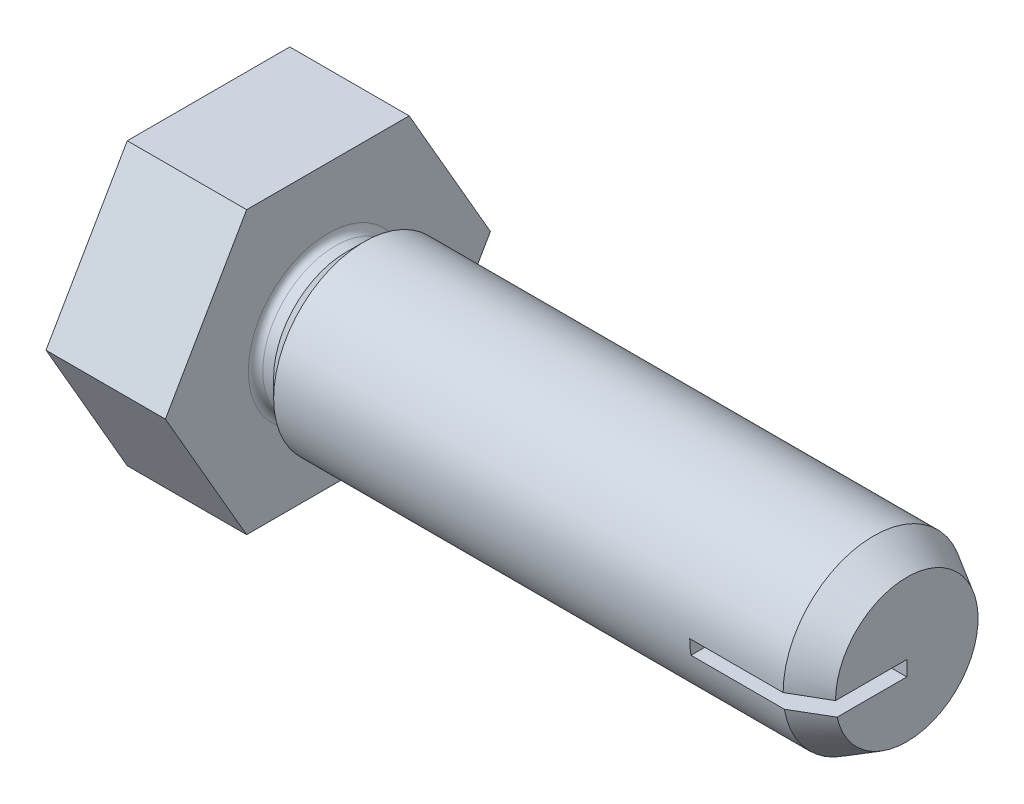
from build123d import *

# Parameters (mm, degrees)
EXTRUDE1_DEPTH           = 3.3
SKETCH11_W               = 3.5
SKETCH11_H               = 0.416666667
POINT_CUT_EXTRUDE8_DEPTH = 18.067754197
SKETCH16_R               = 3.112
CUT_EXTRUDE1_DEPTH       = 0.66


with BuildPart() as part:
    # Sketch1 → base-Revolve (revolve)
    with BuildSketch(Plane.XY, mode=Mode.PRIVATE) as base_revolve_sk:
        with BuildLine():
            Line((16, 2.5), (16, 0))
            Line((16, 0), (0, 0))
            Line((0, 0), (-2.64, 0))
            Line((-2.64, 0), (-3.3, 0))
            Line((-3.3, 0), (-3.3, 3.89))
            Line((-3.3, 3.89), (0, 3.89))
            Line((0, 3.89), (0, 2.2))
            ThreePointArc((0, 2.2), (0.058578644, 2.058578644), (0.2, 2))
            Line((0.2, 2), (0.5, 2))
            Line((0.5, 2), (1, 2.5))
            Line((1, 2.5), (16, 2.5))
        make_face()
    revolve(base_revolve_sk.sketch.rotate(Axis((0, 0, 0), (1, 0, 0)), 90), axis=Axis((0, 0, 0), (1, 0, 0)))

    # Sketch15 → Extrude1 (add)
    with BuildSketch(Plane.ZY.offset(3.3)):
        Polygon((-2.245892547, 3.89), (-4.491785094, 0), (-2.245892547, -3.89), (2.245892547, -3.89), (4.491785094, 0), (2.245892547, 3.89), align=None)
    extrude(amount=-EXTRUDE1_DEPTH)

    # Sketch8 → point_Cut-Revolve1 (revolve, cut)
    with BuildSketch(Plane.XY, mode=Mode.PRIVATE) as point_cut_revolve1_sk:
        Polygon((16, 0), (16.508, 0), (16.508, 3.008), (15.082013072, 3.008), (15.082013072, 2.5), (16, 1.97), align=None)
    revolve(point_cut_revolve1_sk.sketch.rotate(Axis((0, 0, 0), (1, 0, 0)), 90), axis=Axis((0, 0, 0), (1, 0, 0)), mode=Mode.SUBTRACT)

    # Sketch11 → point_Cut-Extrude8 (cut, through all)
    with BuildSketch(Plane.XY):
        with Locations((14.25, -0.208333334)):
            Rectangle(SKETCH11_W, SKETCH11_H)
    extrude(amount=POINT_CUT_EXTRUDE8_DEPTH, mode=Mode.SUBTRACT)

    # Sketch16 → Cut-Extrude1 (cut)
    with BuildSketch(Plane.ZY.offset(3.3)):
        Circle(SKETCH16_R)
    extrude(amount=-CUT_EXTRUDE1_DEPTH, mode=Mode.SUBTRACT)


solid = part.part
